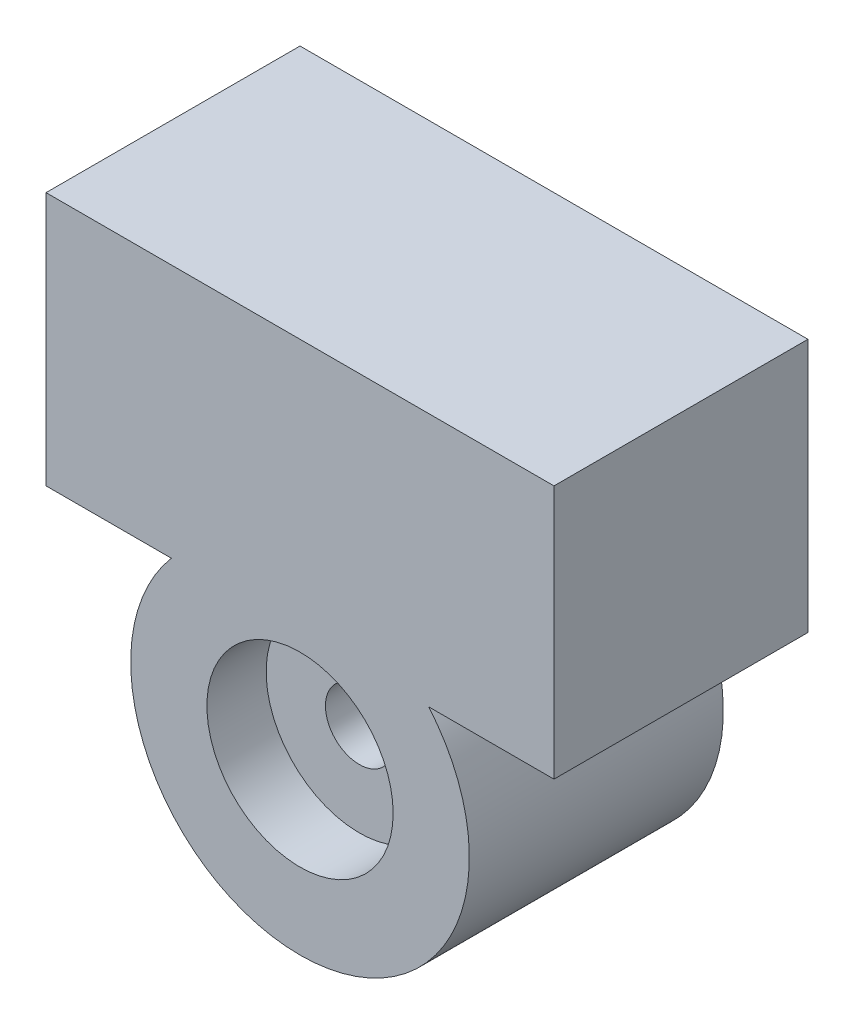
ISO-10303-21;
HEADER;
FILE_DESCRIPTION(('STEP AP214'),'2;1');
FILE_NAME('part.step','',(''),(''),'','','');
FILE_SCHEMA(('AUTOMOTIVE_DESIGN { 1 0 10303 214 1 1 1 1 }'));
ENDSEC;
DATA;
#1=APPLICATION_CONTEXT('core data for automotive mechanical design processes');
#2=APPLICATION_PROTOCOL_DEFINITION('international standard','automotive_design',2000,#1);
#3=PRODUCT_CONTEXT('',#1,'mechanical');
#4=PRODUCT('Part','Part','',(#3));
#5=PRODUCT_RELATED_PRODUCT_CATEGORY('part','',(#4));
#6=PRODUCT_DEFINITION_FORMATION('','',#4);
#7=PRODUCT_DEFINITION_CONTEXT('part definition',#1,'design');
#8=PRODUCT_DEFINITION('design','',#6,#7);
#9=PRODUCT_DEFINITION_SHAPE('','',#8);
#10=(LENGTH_UNIT() NAMED_UNIT(*) SI_UNIT(.MILLI.,.METRE.));
#11=(NAMED_UNIT(*) PLANE_ANGLE_UNIT() SI_UNIT($,.RADIAN.));
#12=(NAMED_UNIT(*) SI_UNIT($,.STERADIAN.) SOLID_ANGLE_UNIT());
#13=UNCERTAINTY_MEASURE_WITH_UNIT(LENGTH_MEASURE(1.E-05),#10,'distance_accuracy_value','');
#14=(GEOMETRIC_REPRESENTATION_CONTEXT(3) GLOBAL_UNCERTAINTY_ASSIGNED_CONTEXT((#13)) GLOBAL_UNIT_ASSIGNED_CONTEXT((#10,
#11,#12)) REPRESENTATION_CONTEXT('',''));
#15=CARTESIAN_POINT('',(0.,0.,0.));
#16=DIRECTION('',(0.,0.,1.));
#17=DIRECTION('',(1.,0.,0.));
#18=AXIS2_PLACEMENT_3D('',#15,#16,#17);
#19=CARTESIAN_POINT('',(0.,0.,30.));
#20=DIRECTION('',(0.,0.,-1.));
#21=DIRECTION('',(-1.,0.,0.));
#22=AXIS2_PLACEMENT_3D('',#19,#20,#21);
#23=CYLINDRICAL_SURFACE('',#22,20.);
#24=CARTESIAN_POINT('',(0.,0.,0.));
#25=DIRECTION('',(0.,0.,1.));
#26=DIRECTION('',(1.,0.,0.));
#27=AXIS2_PLACEMENT_3D('',#24,#25,#26);
#28=CIRCLE('',#27,20.);
#29=CARTESIAN_POINT('',(-15.1986841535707,13.,0.));
#30=VERTEX_POINT('',#29);
#31=CARTESIAN_POINT('',(15.1986841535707,13.,0.));
#32=VERTEX_POINT('',#31);
#33=EDGE_CURVE('E124',#30,#32,#28,.T.);
#34=ORIENTED_EDGE('',*,*,#33,.T.);
#35=DIRECTION('',(0.,0.,-1.));
#36=VECTOR('',#35,1.);
#37=CARTESIAN_POINT('',(15.1986841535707,13.,30.));
#38=LINE('',#37,#36);
#39=CARTESIAN_POINT('',(15.1986841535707,13.,30.));
#40=VERTEX_POINT('',#39);
#41=EDGE_CURVE('E11',#40,#32,#38,.T.);
#42=ORIENTED_EDGE('',*,*,#41,.F.);
#43=CARTESIAN_POINT('',(0.,0.,30.));
#44=DIRECTION('',(0.,0.,1.));
#45=DIRECTION('',(1.,0.,0.));
#46=AXIS2_PLACEMENT_3D('',#43,#44,#45);
#47=CIRCLE('',#46,20.);
#48=CARTESIAN_POINT('',(-15.1986841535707,13.,30.));
#49=VERTEX_POINT('',#48);
#50=EDGE_CURVE('E135',#49,#40,#47,.T.);
#51=ORIENTED_EDGE('',*,*,#50,.F.);
#52=DIRECTION('',(0.,0.,-1.));
#53=VECTOR('',#52,1.);
#54=CARTESIAN_POINT('',(-15.1986841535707,13.,30.));
#55=LINE('',#54,#53);
#56=EDGE_CURVE('E120',#49,#30,#55,.T.);
#57=ORIENTED_EDGE('',*,*,#56,.T.);
#58=EDGE_LOOP('',(#34,#42,#51,#57));
#59=FACE_BOUND('',#58,.T.);
#60=ADVANCED_FACE('F39',(#59),#23,.T.);
#61=CARTESIAN_POINT('',(29.9986841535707,13.,30.));
#62=DIRECTION('',(0.,1.,0.));
#63=DIRECTION('',(-1.,0.,0.));
#64=AXIS2_PLACEMENT_3D('',#61,#62,#63);
#65=PLANE('',#64);
#66=DIRECTION('',(1.,0.,0.));
#67=VECTOR('',#66,1.);
#68=CARTESIAN_POINT('',(29.9986841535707,13.,0.));
#69=LINE('',#68,#67);
#70=CARTESIAN_POINT('',(29.9986841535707,13.,0.));
#71=VERTEX_POINT('',#70);
#72=EDGE_CURVE('E127',#32,#71,#69,.T.);
#73=ORIENTED_EDGE('',*,*,#72,.T.);
#74=DIRECTION('',(0.,0.,-1.));
#75=VECTOR('',#74,1.);
#76=CARTESIAN_POINT('',(29.9986841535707,13.,30.));
#77=LINE('',#76,#75);
#78=CARTESIAN_POINT('',(29.9986841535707,13.,30.));
#79=VERTEX_POINT('',#78);
#80=EDGE_CURVE('E48',#79,#71,#77,.T.);
#81=ORIENTED_EDGE('',*,*,#80,.F.);
#82=DIRECTION('',(1.,0.,0.));
#83=VECTOR('',#82,1.);
#84=CARTESIAN_POINT('',(29.9986841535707,13.,30.));
#85=LINE('',#84,#83);
#86=EDGE_CURVE('E93',#40,#79,#85,.T.);
#87=ORIENTED_EDGE('',*,*,#86,.F.);
#88=ORIENTED_EDGE('',*,*,#41,.T.);
#89=EDGE_LOOP('',(#73,#81,#87,#88));
#90=FACE_BOUND('',#89,.T.);
#91=ADVANCED_FACE('F161',(#90),#65,.F.);
#92=CARTESIAN_POINT('',(29.9986841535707,43.,30.));
#93=DIRECTION('',(-1.,0.,0.));
#94=DIRECTION('',(0.,-1.,0.));
#95=AXIS2_PLACEMENT_3D('',#92,#93,#94);
#96=PLANE('',#95);
#97=DIRECTION('',(0.,1.,0.));
#98=VECTOR('',#97,1.);
#99=CARTESIAN_POINT('',(29.9986841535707,43.,0.));
#100=LINE('',#99,#98);
#101=CARTESIAN_POINT('',(29.9986841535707,43.,0.));
#102=VERTEX_POINT('',#101);
#103=EDGE_CURVE('E130',#71,#102,#100,.T.);
#104=ORIENTED_EDGE('',*,*,#103,.T.);
#105=DIRECTION('',(0.,0.,-1.));
#106=VECTOR('',#105,1.);
#107=CARTESIAN_POINT('',(29.9986841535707,43.,30.));
#108=LINE('',#107,#106);
#109=CARTESIAN_POINT('',(29.9986841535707,43.,30.));
#110=VERTEX_POINT('',#109);
#111=EDGE_CURVE('E115',#110,#102,#108,.T.);
#112=ORIENTED_EDGE('',*,*,#111,.F.);
#113=DIRECTION('',(0.,1.,0.));
#114=VECTOR('',#113,1.);
#115=CARTESIAN_POINT('',(29.9986841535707,43.,30.));
#116=LINE('',#115,#114);
#117=EDGE_CURVE('E106',#79,#110,#116,.T.);
#118=ORIENTED_EDGE('',*,*,#117,.F.);
#119=ORIENTED_EDGE('',*,*,#80,.T.);
#120=EDGE_LOOP('',(#104,#112,#118,#119));
#121=FACE_BOUND('',#120,.T.);
#122=ADVANCED_FACE('F142',(#121),#96,.F.);
#123=CARTESIAN_POINT('',(-30.0013158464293,43.,30.));
#124=DIRECTION('',(0.,-1.,0.));
#125=DIRECTION('',(0.,0.,-1.));
#126=AXIS2_PLACEMENT_3D('',#123,#124,#125);
#127=PLANE('',#126);
#128=DIRECTION('',(-1.,0.,0.));
#129=VECTOR('',#128,1.);
#130=CARTESIAN_POINT('',(-30.0013158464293,43.,0.));
#131=LINE('',#130,#129);
#132=CARTESIAN_POINT('',(-30.0013158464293,43.,0.));
#133=VERTEX_POINT('',#132);
#134=EDGE_CURVE('E114',#102,#133,#131,.T.);
#135=ORIENTED_EDGE('',*,*,#134,.T.);
#136=DIRECTION('',(0.,0.,-1.));
#137=VECTOR('',#136,1.);
#138=CARTESIAN_POINT('',(-30.0013158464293,43.,30.));
#139=LINE('',#138,#137);
#140=CARTESIAN_POINT('',(-30.0013158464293,43.,30.));
#141=VERTEX_POINT('',#140);
#142=EDGE_CURVE('E111',#141,#133,#139,.T.);
#143=ORIENTED_EDGE('',*,*,#142,.F.);
#144=DIRECTION('',(-1.,0.,0.));
#145=VECTOR('',#144,1.);
#146=CARTESIAN_POINT('',(-30.0013158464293,43.,30.));
#147=LINE('',#146,#145);
#148=EDGE_CURVE('E100',#110,#141,#147,.T.);
#149=ORIENTED_EDGE('',*,*,#148,.F.);
#150=ORIENTED_EDGE('',*,*,#111,.T.);
#151=EDGE_LOOP('',(#135,#143,#149,#150));
#152=FACE_BOUND('',#151,.T.);
#153=ADVANCED_FACE('F112',(#152),#127,.F.);
#154=CARTESIAN_POINT('',(-30.0013158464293,13.,30.));
#155=DIRECTION('',(1.,0.,0.));
#156=DIRECTION('',(0.,1.,0.));
#157=AXIS2_PLACEMENT_3D('',#154,#155,#156);
#158=PLANE('',#157);
#159=DIRECTION('',(0.,-1.,0.));
#160=VECTOR('',#159,1.);
#161=CARTESIAN_POINT('',(-30.0013158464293,13.,0.));
#162=LINE('',#161,#160);
#163=CARTESIAN_POINT('',(-30.0013158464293,13.,0.));
#164=VERTEX_POINT('',#163);
#165=EDGE_CURVE('E79',#133,#164,#162,.T.);
#166=ORIENTED_EDGE('',*,*,#165,.T.);
#167=DIRECTION('',(0.,0.,-1.));
#168=VECTOR('',#167,1.);
#169=CARTESIAN_POINT('',(-30.0013158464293,13.,30.));
#170=LINE('',#169,#168);
#171=CARTESIAN_POINT('',(-30.0013158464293,13.,30.));
#172=VERTEX_POINT('',#171);
#173=EDGE_CURVE('E116',#172,#164,#170,.T.);
#174=ORIENTED_EDGE('',*,*,#173,.F.);
#175=DIRECTION('',(0.,-1.,0.));
#176=VECTOR('',#175,1.);
#177=CARTESIAN_POINT('',(-30.0013158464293,13.,30.));
#178=LINE('',#177,#176);
#179=EDGE_CURVE('E104',#141,#172,#178,.T.);
#180=ORIENTED_EDGE('',*,*,#179,.F.);
#181=ORIENTED_EDGE('',*,*,#142,.T.);
#182=EDGE_LOOP('',(#166,#174,#180,#181));
#183=FACE_BOUND('',#182,.T.);
#184=ADVANCED_FACE('F118',(#183),#158,.F.);
#185=CARTESIAN_POINT('',(-15.1986841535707,13.,30.));
#186=DIRECTION('',(0.,1.,0.));
#187=DIRECTION('',(-1.,0.,0.));
#188=AXIS2_PLACEMENT_3D('',#185,#186,#187);
#189=PLANE('',#188);
#190=DIRECTION('',(1.,0.,0.));
#191=VECTOR('',#190,1.);
#192=CARTESIAN_POINT('',(-15.1986841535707,13.,0.));
#193=LINE('',#192,#191);
#194=EDGE_CURVE('E85',#164,#30,#193,.T.);
#195=ORIENTED_EDGE('',*,*,#194,.T.);
#196=ORIENTED_EDGE('',*,*,#56,.F.);
#197=DIRECTION('',(1.,0.,0.));
#198=VECTOR('',#197,1.);
#199=CARTESIAN_POINT('',(-15.1986841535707,13.,30.));
#200=LINE('',#199,#198);
#201=EDGE_CURVE('E56',#172,#49,#200,.T.);
#202=ORIENTED_EDGE('',*,*,#201,.F.);
#203=ORIENTED_EDGE('',*,*,#173,.T.);
#204=EDGE_LOOP('',(#195,#196,#202,#203));
#205=FACE_BOUND('',#204,.T.);
#206=ADVANCED_FACE('F149',(#205),#189,.F.);
#207=CARTESIAN_POINT('',(0.,0.,30.));
#208=DIRECTION('',(0.,0.,1.));
#209=DIRECTION('',(1.,0.,0.));
#210=AXIS2_PLACEMENT_3D('',#207,#208,#209);
#211=PLANE('',#210);
#212=CARTESIAN_POINT('',(0.,0.,30.));
#213=DIRECTION('',(0.,0.,1.));
#214=DIRECTION('',(1.,0.,0.));
#215=AXIS2_PLACEMENT_3D('',#212,#213,#214);
#216=CIRCLE('',#215,11.);
#217=CARTESIAN_POINT('',(11.,0.,30.));
#218=VERTEX_POINT('',#217);
#219=EDGE_CURVE('E239',#218,#218,#216,.T.);
#220=ORIENTED_EDGE('',*,*,#219,.F.);
#221=EDGE_LOOP('',(#220));
#222=FACE_BOUND('',#221,.T.);
#223=ORIENTED_EDGE('',*,*,#50,.T.);
#224=ORIENTED_EDGE('',*,*,#86,.T.);
#225=ORIENTED_EDGE('',*,*,#117,.T.);
#226=ORIENTED_EDGE('',*,*,#148,.T.);
#227=ORIENTED_EDGE('',*,*,#179,.T.);
#228=ORIENTED_EDGE('',*,*,#201,.T.);
#229=EDGE_LOOP('',(#223,#224,#225,#226,#227,#228));
#230=FACE_BOUND('',#229,.T.);
#231=ADVANCED_FACE('F102',(#222,#230),#211,.T.);
#232=CARTESIAN_POINT('',(0.,0.,0.));
#233=DIRECTION('',(0.,0.,1.));
#234=DIRECTION('',(1.,0.,0.));
#235=AXIS2_PLACEMENT_3D('',#232,#233,#234);
#236=PLANE('',#235);
#237=CARTESIAN_POINT('',(0.,0.,0.));
#238=DIRECTION('',(0.,0.,1.));
#239=DIRECTION('',(1.,0.,0.));
#240=AXIS2_PLACEMENT_3D('',#237,#238,#239);
#241=CIRCLE('',#240,4.);
#242=CARTESIAN_POINT('',(4.,0.,0.));
#243=VERTEX_POINT('',#242);
#244=EDGE_CURVE('E237',#243,#243,#241,.T.);
#245=ORIENTED_EDGE('',*,*,#244,.T.);
#246=EDGE_LOOP('',(#245));
#247=FACE_BOUND('',#246,.T.);
#248=ORIENTED_EDGE('',*,*,#33,.F.);
#249=ORIENTED_EDGE('',*,*,#194,.F.);
#250=ORIENTED_EDGE('',*,*,#165,.F.);
#251=ORIENTED_EDGE('',*,*,#134,.F.);
#252=ORIENTED_EDGE('',*,*,#103,.F.);
#253=ORIENTED_EDGE('',*,*,#72,.F.);
#254=EDGE_LOOP('',(#248,#249,#250,#251,#252,#253));
#255=FACE_BOUND('',#254,.T.);
#256=ADVANCED_FACE('F145',(#247,#255),#236,.F.);
#257=CARTESIAN_POINT('',(0.,0.,23.));
#258=DIRECTION('',(0.,0.,1.));
#259=DIRECTION('',(1.,0.,0.));
#260=AXIS2_PLACEMENT_3D('',#257,#258,#259);
#261=CYLINDRICAL_SURFACE('',#260,11.);
#262=CARTESIAN_POINT('',(0.,0.,23.));
#263=DIRECTION('',(0.,0.,1.));
#264=DIRECTION('',(1.,0.,0.));
#265=AXIS2_PLACEMENT_3D('',#262,#263,#264);
#266=CIRCLE('',#265,11.);
#267=CARTESIAN_POINT('',(11.,0.,23.));
#268=VERTEX_POINT('',#267);
#269=EDGE_CURVE('E128',#268,#268,#266,.T.);
#270=ORIENTED_EDGE('',*,*,#269,.F.);
#271=EDGE_LOOP('',(#270));
#272=FACE_BOUND('',#271,.T.);
#273=ORIENTED_EDGE('',*,*,#219,.T.);
#274=EDGE_LOOP('',(#273));
#275=FACE_BOUND('',#274,.T.);
#276=ADVANCED_FACE('F201',(#272,#275),#261,.F.);
#277=CARTESIAN_POINT('',(0.,0.,23.));
#278=DIRECTION('',(0.,0.,1.));
#279=DIRECTION('',(1.,0.,0.));
#280=AXIS2_PLACEMENT_3D('',#277,#278,#279);
#281=PLANE('',#280);
#282=CARTESIAN_POINT('',(0.,0.,23.));
#283=DIRECTION('',(0.,0.,1.));
#284=DIRECTION('',(1.,0.,0.));
#285=AXIS2_PLACEMENT_3D('',#282,#283,#284);
#286=CIRCLE('',#285,4.);
#287=CARTESIAN_POINT('',(4.,0.,23.));
#288=VERTEX_POINT('',#287);
#289=EDGE_CURVE('E42',#288,#288,#286,.T.);
#290=ORIENTED_EDGE('',*,*,#289,.F.);
#291=EDGE_LOOP('',(#290));
#292=FACE_BOUND('',#291,.T.);
#293=ORIENTED_EDGE('',*,*,#269,.T.);
#294=EDGE_LOOP('',(#293));
#295=FACE_BOUND('',#294,.T.);
#296=ADVANCED_FACE('F210',(#292,#295),#281,.T.);
#297=CARTESIAN_POINT('',(0.,0.,0.));
#298=DIRECTION('',(0.,0.,1.));
#299=DIRECTION('',(1.,0.,0.));
#300=AXIS2_PLACEMENT_3D('',#297,#298,#299);
#301=CYLINDRICAL_SURFACE('',#300,4.);
#302=ORIENTED_EDGE('',*,*,#289,.T.);
#303=EDGE_LOOP('',(#302));
#304=FACE_BOUND('',#303,.T.);
#305=ORIENTED_EDGE('',*,*,#244,.F.);
#306=EDGE_LOOP('',(#305));
#307=FACE_BOUND('',#306,.T.);
#308=ADVANCED_FACE('F219',(#304,#307),#301,.F.);
#309=CLOSED_SHELL('',(#60,#91,#122,#153,#184,#206,#231,#256,#276,#296,#308));
#310=MANIFOLD_SOLID_BREP('B2',#309);
#311=ADVANCED_BREP_SHAPE_REPRESENTATION('',(#18,#310),#14);
#312=SHAPE_DEFINITION_REPRESENTATION(#9,#311);
ENDSEC;
END-ISO-10303-21;
